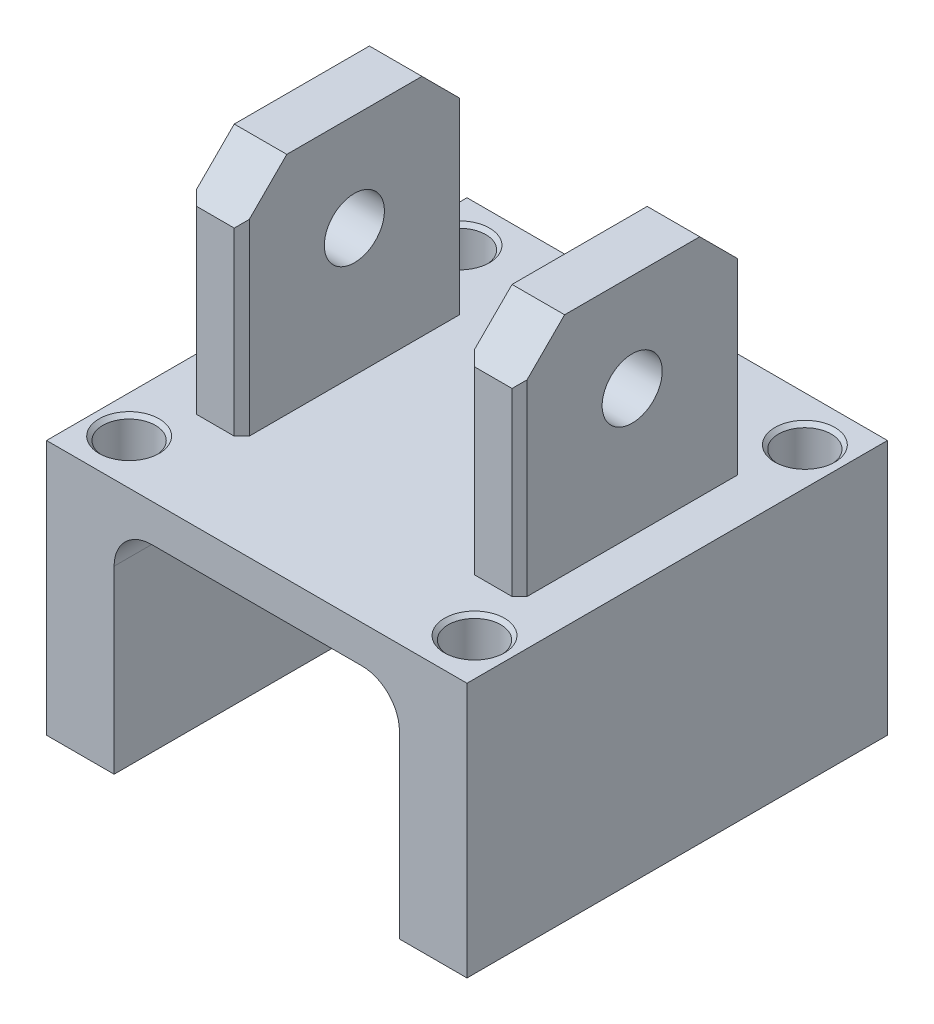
from build123d import *

# Parameters (mm, degrees)
SKETCH_1_W                  = 56
SKETCH_1_H                  = 56
EXTRUDE_1_DEPTH             = 34
CUT_EXTRUDE_1_DEPTH         = 53.191953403
CUT_EXTRUDE_1_DEPTH_BACK    = 53.191953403
SKETCH_3_W                  = 7
SKETCH_3_H                  = 30
EXTRUDE_2_DEPTH             = 30
CHANFREIN1_SIZE             = 6
CHAMFER_1_SIZE              = 1
CUT_EXTRUDE_2_REACH         = 87.907
SKETCH_4_R                  = 4
SKETCH_7_R                  = 2.5
CUT_EXTRUDE_7_DEPTH         = 10
SKETCH_8_R                  = 3.5
CUT_EXTRUDE_8_DEPTH         = 15
CHAMFER_2_SIZE              = 0.5
HOLE_WIZARD_M51_D           = 3.2
HOLE_WIZARD_M51_CBORE_D     = 6
HOLE_WIZARD_M51_CBORE_DEPTH = 4


with BuildPart() as part:
    # Sketch 1 → Extrude 1 (new body)
    with BuildSketch(Plane(origin=(0, 0, 0), x_dir=(1, 0, 0), z_dir=(0, 1, 0))):
        Rectangle(SKETCH_1_W, SKETCH_1_H)
    extrude(amount=EXTRUDE_1_DEPTH)

    # Sketch 2 → Cut-Extrude 1 (cut, two sides: drawn at the far end of the back side and taken through both)
    with BuildSketch(Plane.XY.offset(-CUT_EXTRUDE_1_DEPTH_BACK)):
        with BuildLine():
            Line((-19, 0), (19, 0))
            Line((19, 0), (19, 24))
            ThreePointArc((19, 24), (17.535533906, 27.535533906), (14, 29))
            Line((14, 29), (-14, 29))
            ThreePointArc((-14, 29), (-17.535533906, 27.535533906), (-19, 24))
            Line((-19, 24), (-19, 0))
        make_face()
    extrude(amount=CUT_EXTRUDE_1_DEPTH + CUT_EXTRUDE_1_DEPTH_BACK, mode=Mode.SUBTRACT)

    # Sketch 3 → Extrude 2 (add)
    with BuildSketch(Plane(origin=(0, 34, 0), x_dir=(1, 0, 0), z_dir=(0, 1, 0))):
        with Locations((-18.5, 0)):
            Rectangle(SKETCH_3_W, SKETCH_3_H)
        with Locations((18.5, 0)):
            Rectangle(SKETCH_3_W, SKETCH_3_H)
    extrude(amount=EXTRUDE_2_DEPTH)

    # Chanfrein1
    chanfrein1_edges = [part.edges().sort_by_distance(p)[0] for p in [
        (-18.5, 64, 15),
        (-18.5, 64, -15),
        (18.5, 64, -15),
        (18.5, 64, 15),
    ]]
    chamfer(chanfrein1_edges, length=CHANFREIN1_SIZE)

    # Chamfer 1
    chamfer_1_edges = [part.edges().sort_by_distance(p)[0] for p in [
        (15, 46, 15),
        (15, 46, -15),
        (22, 46, -15),
        (22, 46, 15),
        (-22, 46, 15),
        (-22, 46, -15),
        (-15, 46, -15),
        (-15, 46, 15),
    ]]
    chamfer(chamfer_1_edges, length=CHAMFER_1_SIZE)

    # Cut-Extrude 2: up to this face of the body (flat: up to its plane)
    cut_extrude_2_end = Plane(part.part.faces().sort_by_distance((-22, 48.591002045, 0))[0])
    # Sketch 4 → Cut-Extrude 2 (cut, up to the picked face)
    with BuildSketch(Plane(origin=(22, 0, 0), x_dir=(0, 0, -1), z_dir=(1, 0, 0)), mode=Mode.PRIVATE) as cut_extrude_2_sk1:
        with Locations((0, 51)):
            Circle(SKETCH_4_R)
    cut_extrude_2_tool1 = split(extrude(cut_extrude_2_sk1.sketch, amount=-CUT_EXTRUDE_2_REACH, mode=Mode.PRIVATE), bisect_by=cut_extrude_2_end, keep=Keep.BOTH, mode=Mode.PRIVATE)
    add(cut_extrude_2_tool1.solids().sort_by(Axis((22, 51, 0), (-1, 0, 0)))[0], mode=Mode.SUBTRACT)

    # Sketch 7 → Cut-Extrude 7 (cut)
    with BuildSketch(Plane.XZ):
        with Locations(Location((-23, 22, 0), (0, 0, 270))):
            Circle(SKETCH_7_R)
        with Locations(Location((-23, -22, 0), (0, 0, 90))):
            Circle(SKETCH_7_R)
        with Locations(Location((23, -22, 0), (0, 0, 270))):
            Circle(SKETCH_7_R)
        with Locations(Location((23, 22, 0), (0, 0, 90))):
            Circle(SKETCH_7_R)
    extrude(amount=-CUT_EXTRUDE_7_DEPTH, mode=Mode.SUBTRACT)

    # Sketch 8 → Cut-Extrude 8 (cut)
    with BuildSketch(Plane(origin=(0, 34, 0), x_dir=(1, 0, 0), z_dir=(0, 1, 0))):
        with Locations(Location((-23, 22, 0), (0, 0, 270))):
            Circle(SKETCH_8_R)
        with Locations(Location((-23, -22, 0), (0, 0, 270))):
            Circle(SKETCH_8_R)
        with Locations(Location((23, 22, 0), (0, 0, 270))):
            Circle(SKETCH_8_R)
        with Locations(Location((23, -22, 0), (0, 0, 270))):
            Circle(SKETCH_8_R)
    extrude(amount=-CUT_EXTRUDE_8_DEPTH, mode=Mode.SUBTRACT)

    # Chamfer 2
    chamfer_2_edges = [part.edges().sort_by_distance(p)[0] for p in [
        (-23, 0, 24.5),
        (-23, 0, -24.5),
        (23, 0, -19.5),
        (23, 0, 19.5),
        (-23, 34, -25.5),
        (-23, 34, 18.5),
        (23, 34, -25.5),
        (23, 34, 18.5),
    ]]
    chamfer(chamfer_2_edges, length=CHAMFER_2_SIZE)

    # Hole Wizard M51 (through all)
    with Locations(Plane(origin=(0, 34, 0), x_dir=(-1, 0, 0), z_dir=(0, 1, 0))):
        with Locations((5.744139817, -21.005), (-3.955860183, -21.005)):
            CounterBoreHole(HOLE_WIZARD_M51_D / 2, HOLE_WIZARD_M51_CBORE_D / 2, HOLE_WIZARD_M51_CBORE_DEPTH)


solid = part.part
